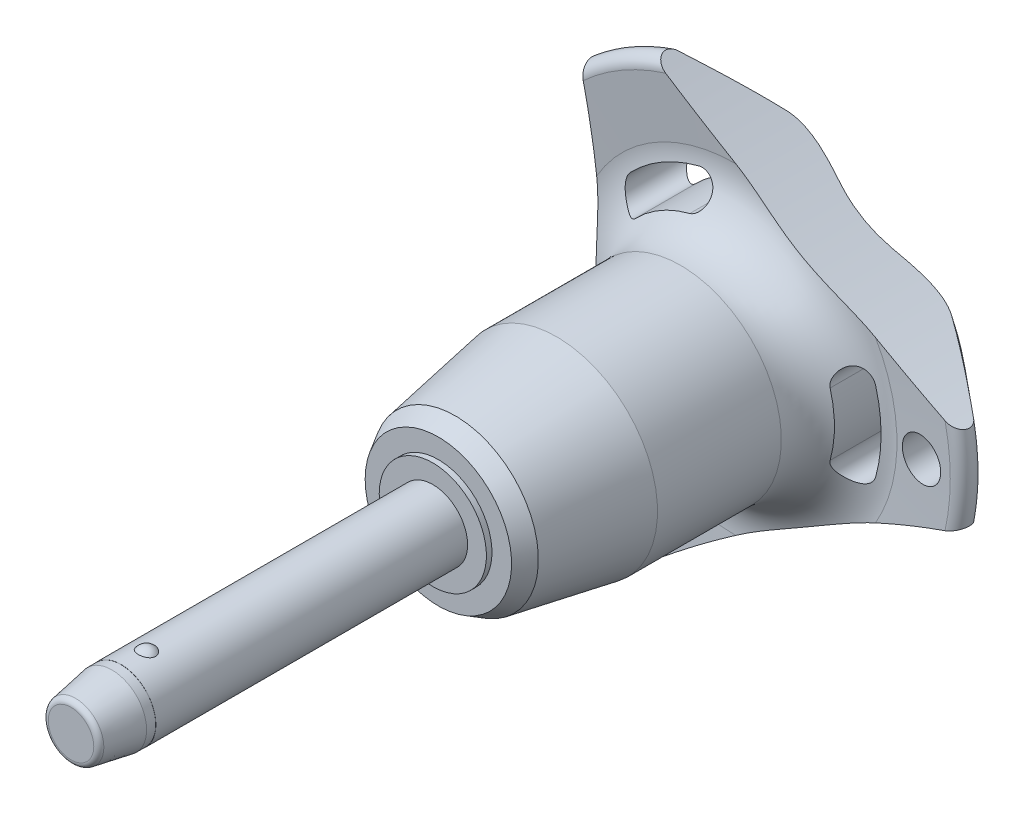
from build123d import *

# Parameters (mm, degrees)
SKETCH1_R           = 2.5
BOSS_EXTRUDE1_DEPTH = 20
SKETCH2_R           = 2.1
BOSS_EXTRUDE2_DEPTH = 26.7
BOSS_EXTRUDE3_START = 6
SKETCH1_2_R         = 2.5
BOSS_EXTRUDE3_DEPTH = 6
CHAMFER1_SIZE       = 3
CHAMFER1_SIZE2      = 0.528980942
FILLET1_R           = 0.4
SKETCH6_R           = 79.96
CUT_EXTRUDE1_DEPTH  = 53.269297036
CIRPATTERN1_COUNT   = 3
SKETCH7_R           = 1.5
CUT_EXTRUDE2_DEPTH  = 52.977278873
SKETCH8_R           = 2.5
SKETCH8_R_2         = 2.49
CUT_EXTRUDE3_DEPTH  = 3.6


with BuildPart() as part:
    # Sketch1 → Boss-Extrude1 (new body)
    with BuildSketch(Plane.XY):
        Circle(SKETCH1_R)
    extrude(amount=-BOSS_EXTRUDE1_DEPTH)

    # Sketch2 → Boss-Extrude2 (add)
    with BuildSketch(Plane(origin=(0, 0, -20), x_dir=(-1, 0, 0), z_dir=(0, 0, -1))):
        Circle(SKETCH2_R)
    extrude(amount=BOSS_EXTRUDE2_DEPTH)

    # Sketch3 → Revolve1 (revolve)
    with BuildSketch(Plane(origin=(0, 0, 0), x_dir=(0, 0, -1), z_dir=(1, 0, 0))):
        with BuildLine():
            Line((-0.580947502, 2.75), (-0.580947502, 1.15))
            ThreePointArc((-0.580947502, 1.15), (0.219052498, 1.95), (-0.580947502, 2.75))
        make_face()
        with BuildLine():
            Line((-0.580947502, -1.15), (-0.580947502, -2.75))
            ThreePointArc((-0.580947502, -2.75), (0.219052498, -1.95), (-0.580947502, -1.15))
        make_face()
    revolve(axis=Axis((0, -1.15, 0.580947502), (0, 1, 0)))

    # Sketch1_2 → Boss-Extrude3 (add)
    with BuildSketch(Plane.XY.offset(BOSS_EXTRUDE3_START)):
        Circle(SKETCH1_2_R)
    extrude(amount=-BOSS_EXTRUDE3_DEPTH)

    # Chamfer1
    chamfer1_edges = [part.edges().sort_by_distance(p)[0] for p in [
        (-2.5, 0, 6),
    ]]
    chamfer1_side = [part.faces().sort_by_distance(p)[0] for p in [
        (-2.5, 0, -7),
    ]]
    chamfer(chamfer1_edges, length=CHAMFER1_SIZE, length2=CHAMFER1_SIZE2, reference=chamfer1_side[0])

    # Fillet1
    fillet1_edges = [part.edges().sort_by_distance(p)[0] for p in [
        (-1.971019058, 0, 6),
        (2.1, 0, -46.7),
    ]]
    fillet(fillet1_edges, radius=FILLET1_R)

    # Sketch4 → Revolve2 (revolve)
    with BuildSketch(Plane(origin=(0, 0, 0), x_dir=(0, 0, -1), z_dir=(1, 0, 0)), mode=Mode.PRIVATE) as revolve2_sk:
        Polygon((20, 0), (20, 3.851837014), (20.4, 3.851837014), (20.4, 5.26161122), (21.620900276, 5.966498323), (28.9, 7.25), (37.8, 7.25), (37.8, 0), align=None)
    revolve(revolve2_sk.sketch.rotate(Axis((0, 0, -37.8), (0, 0, 1)), 90), axis=Axis((0, 0, -37.8), (0, 0, 1)))

    # Sketch5 → Revolve3 (revolve)
    with BuildSketch(Plane(origin=(0, 0, 0), x_dir=(0, 0, -1), z_dir=(1, 0, 0)), mode=Mode.PRIVATE) as revolve3_sk:
        with BuildLine():
            Line((41.78715932, 11.570250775), (41.452568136, 15.735949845))
            ThreePointArc((41.452568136, 15.735949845), (41.946485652, 16.540188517), (42.862835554, 16.314230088))
            Line((42.862835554, 16.314230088), (46.326414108, 12.186497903))
            ThreePointArc((46.326414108, 12.186497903), (46.7, 11.109282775), (46.261488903, 10.056825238))
            ThreePointArc((46.261488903, 10.056825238), (43.289873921, 5.413681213), (42.25, 0))
            Line((42.25, 0), (37.8, 0))
            Line((37.8, 0), (37.8, 7.25))
            ThreePointArc((37.8, 7.25), (40.739473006, 8.537160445), (41.78715932, 11.570250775))
        make_face()
    revolve(revolve3_sk.sketch.rotate(Axis((0, 0, -42.25), (0, 0, 1)), 90), axis=Axis((0, 0, -42.25), (0, 0, 1)))

    # Sketch6 → Cut-Extrude1 (cut, through all)
    with BuildSketch(Plane.XY):
        with Locations((-89.76, 0)):
            Circle(SKETCH6_R)
        with BuildLine():
            ThreePointArc((10.099921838, -2.834717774), (10.490188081, 0), (10.099921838, 2.834717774))
            ThreePointArc((10.099921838, 2.834717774), (8.768180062, 3.582738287), (8.020159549, 2.250996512))
            ThreePointArc((8.020159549, 2.250996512), (8.330062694, 0), (8.020159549, -2.250996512))
            ThreePointArc((8.020159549, -2.250996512), (8.768180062, -3.582738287), (10.099921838, -2.834717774))
        make_face()
    cut_extrude1 = extrude(amount=-CUT_EXTRUDE1_DEPTH, mode=Mode.SUBTRACT)

    # CirPattern1: Cut-Extrude1 ×3 about axis
    cirpattern1_axis = Axis((0, 0, 0), (0, 0, 1))
    for i in range(1, CIRPATTERN1_COUNT):
        add(cut_extrude1.rotate(cirpattern1_axis, i * 360 / CIRPATTERN1_COUNT), mode=Mode.SUBTRACT)

    # Sketch7 → Cut-Extrude2 (cut, through all)
    with BuildSketch(Plane.XY):
        with Locations(Location((13.490188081, 0, 0), (0, 0, 225.221865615))):
            Circle(SKETCH7_R)
    extrude(amount=-CUT_EXTRUDE2_DEPTH, mode=Mode.SUBTRACT)

    # Sketch8 → Cut-Extrude3 (cut)
    with BuildSketch(Plane.XY.offset(6)):
        Circle(SKETCH8_R)
        Circle(SKETCH8_R_2, mode=Mode.SUBTRACT)
    extrude(amount=-CUT_EXTRUDE3_DEPTH, mode=Mode.SUBTRACT)


solid = part.part
